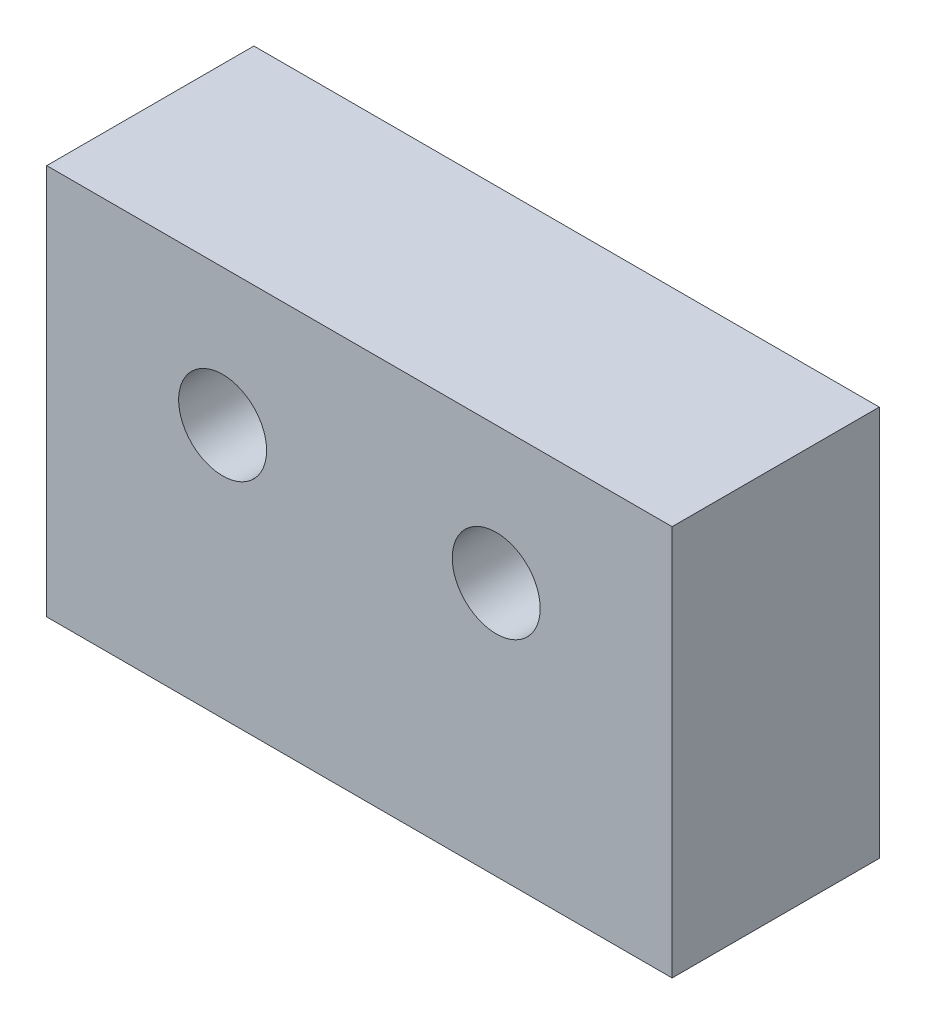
from build123d import *

# Parameters (mm, degrees)
SKETCH_2_W      = 32
SKETCH_2_H      = 20
SKETCH_2_R      = 2.25
EXTRUDE_1_DEPTH = 10.6


with BuildPart() as part:
    # Sketch 2 → Extrude 1 (new body)
    with BuildSketch(Plane.XY):
        with Locations((16, -10)):
            Rectangle(SKETCH_2_W, SKETCH_2_H)
        with Locations((9, -7)):
            Circle(SKETCH_2_R, mode=Mode.SUBTRACT)
        with Locations((23, -7)):
            Circle(SKETCH_2_R, mode=Mode.SUBTRACT)
    extrude(amount=EXTRUDE_1_DEPTH)


solid = part.part
